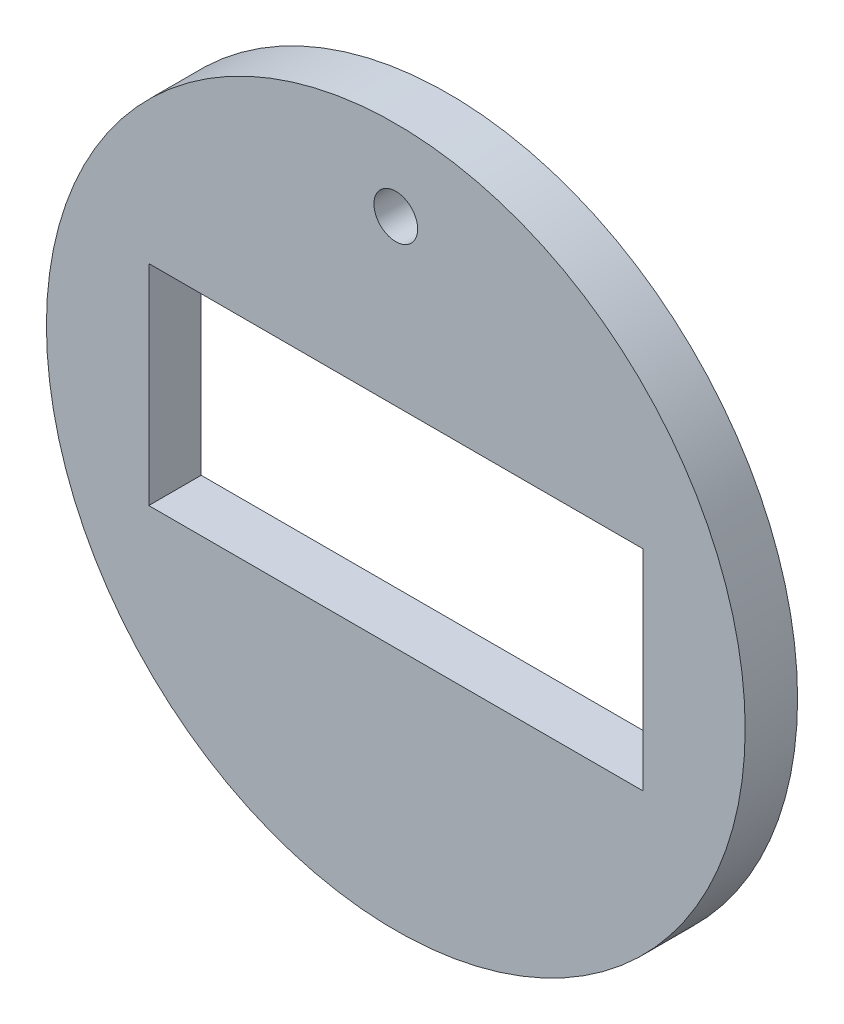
ISO-10303-21;
HEADER;
FILE_DESCRIPTION(('STEP AP214'),'2;1');
FILE_NAME('part.step','',(''),(''),'','','');
FILE_SCHEMA(('AUTOMOTIVE_DESIGN { 1 0 10303 214 1 1 1 1 }'));
ENDSEC;
DATA;
#1=APPLICATION_CONTEXT('core data for automotive mechanical design processes');
#2=APPLICATION_PROTOCOL_DEFINITION('international standard','automotive_design',2000,#1);
#3=PRODUCT_CONTEXT('',#1,'mechanical');
#4=PRODUCT('Part','Part','',(#3));
#5=PRODUCT_RELATED_PRODUCT_CATEGORY('part','',(#4));
#6=PRODUCT_DEFINITION_FORMATION('','',#4);
#7=PRODUCT_DEFINITION_CONTEXT('part definition',#1,'design');
#8=PRODUCT_DEFINITION('design','',#6,#7);
#9=PRODUCT_DEFINITION_SHAPE('','',#8);
#10=(LENGTH_UNIT() NAMED_UNIT(*) SI_UNIT(.MILLI.,.METRE.));
#11=(NAMED_UNIT(*) PLANE_ANGLE_UNIT() SI_UNIT($,.RADIAN.));
#12=(NAMED_UNIT(*) SI_UNIT($,.STERADIAN.) SOLID_ANGLE_UNIT());
#13=UNCERTAINTY_MEASURE_WITH_UNIT(LENGTH_MEASURE(1.E-05),#10,'distance_accuracy_value','');
#14=(GEOMETRIC_REPRESENTATION_CONTEXT(3) GLOBAL_UNCERTAINTY_ASSIGNED_CONTEXT((#13)) GLOBAL_UNIT_ASSIGNED_CONTEXT((#10,
#11,#12)) REPRESENTATION_CONTEXT('',''));
#15=CARTESIAN_POINT('',(0.,0.,0.));
#16=DIRECTION('',(0.,0.,1.));
#17=DIRECTION('',(1.,0.,0.));
#18=AXIS2_PLACEMENT_3D('',#15,#16,#17);
#19=CARTESIAN_POINT('',(0.,0.,3.81));
#20=DIRECTION('',(0.,0.,1.));
#21=DIRECTION('',(1.,0.,0.));
#22=AXIS2_PLACEMENT_3D('',#19,#20,#21);
#23=PLANE('',#22);
#24=CARTESIAN_POINT('',(0.,19.558,3.81));
#25=DIRECTION('',(0.,0.,1.));
#26=DIRECTION('',(1.,0.,0.));
#27=AXIS2_PLACEMENT_3D('',#24,#25,#26);
#28=CIRCLE('',#27,1.5875);
#29=CARTESIAN_POINT('',(-1.5875,19.558,3.81));
#30=VERTEX_POINT('',#29);
#31=EDGE_CURVE('E110',#30,#30,#28,.T.);
#32=ORIENTED_EDGE('',*,*,#31,.F.);
#33=EDGE_LOOP('',(#32));
#34=FACE_BOUND('',#33,.T.);
#35=CARTESIAN_POINT('',(0.,0.,3.81));
#36=DIRECTION('',(0.,0.,1.));
#37=DIRECTION('',(1.,0.,0.));
#38=AXIS2_PLACEMENT_3D('',#35,#36,#37);
#39=CIRCLE('',#38,25.4);
#40=CARTESIAN_POINT('',(-25.4,0.,3.81));
#41=VERTEX_POINT('',#40);
#42=EDGE_CURVE('E11',#41,#41,#39,.T.);
#43=ORIENTED_EDGE('',*,*,#42,.T.);
#44=EDGE_LOOP('',(#43));
#45=FACE_BOUND('',#44,.T.);
#46=DIRECTION('',(1.,0.,0.));
#47=VECTOR('',#46,1.);
#48=CARTESIAN_POINT('',(17.9578,-7.62,3.81));
#49=LINE('',#48,#47);
#50=CARTESIAN_POINT('',(-17.9578,-7.62,3.81));
#51=VERTEX_POINT('',#50);
#52=CARTESIAN_POINT('',(17.9578,-7.62,3.81));
#53=VERTEX_POINT('',#52);
#54=EDGE_CURVE('E98',#51,#53,#49,.T.);
#55=ORIENTED_EDGE('',*,*,#54,.F.);
#56=DIRECTION('',(0.,-1.,0.));
#57=VECTOR('',#56,1.);
#58=CARTESIAN_POINT('',(-17.9578,7.62,3.81));
#59=LINE('',#58,#57);
#60=CARTESIAN_POINT('',(-17.9578,7.62,3.81));
#61=VERTEX_POINT('',#60);
#62=EDGE_CURVE('E87',#61,#51,#59,.T.);
#63=ORIENTED_EDGE('',*,*,#62,.F.);
#64=DIRECTION('',(-1.,0.,0.));
#65=VECTOR('',#64,1.);
#66=CARTESIAN_POINT('',(-17.9578,7.62,3.81));
#67=LINE('',#66,#65);
#68=CARTESIAN_POINT('',(17.9578,7.62,3.81));
#69=VERTEX_POINT('',#68);
#70=EDGE_CURVE('E102',#69,#61,#67,.T.);
#71=ORIENTED_EDGE('',*,*,#70,.F.);
#72=DIRECTION('',(0.,1.,0.));
#73=VECTOR('',#72,1.);
#74=CARTESIAN_POINT('',(17.9578,7.62,3.81));
#75=LINE('',#74,#73);
#76=EDGE_CURVE('E100',#53,#69,#75,.T.);
#77=ORIENTED_EDGE('',*,*,#76,.F.);
#78=EDGE_LOOP('',(#55,#63,#71,#77));
#79=FACE_BOUND('',#78,.T.);
#80=ADVANCED_FACE('F31',(#34,#45,#79),#23,.T.);
#81=CARTESIAN_POINT('',(0.,0.,0.));
#82=DIRECTION('',(0.,0.,1.));
#83=DIRECTION('',(1.,0.,0.));
#84=AXIS2_PLACEMENT_3D('',#81,#82,#83);
#85=PLANE('',#84);
#86=CARTESIAN_POINT('',(0.,19.558,0.));
#87=DIRECTION('',(0.,0.,1.));
#88=DIRECTION('',(1.,0.,0.));
#89=AXIS2_PLACEMENT_3D('',#86,#87,#88);
#90=CIRCLE('',#89,1.5875);
#91=CARTESIAN_POINT('',(-1.5875,19.558,0.));
#92=VERTEX_POINT('',#91);
#93=EDGE_CURVE('E88',#92,#92,#90,.T.);
#94=ORIENTED_EDGE('',*,*,#93,.T.);
#95=EDGE_LOOP('',(#94));
#96=FACE_BOUND('',#95,.T.);
#97=CARTESIAN_POINT('',(0.,0.,0.));
#98=DIRECTION('',(0.,0.,1.));
#99=DIRECTION('',(1.,0.,0.));
#100=AXIS2_PLACEMENT_3D('',#97,#98,#99);
#101=CIRCLE('',#100,25.4);
#102=CARTESIAN_POINT('',(-25.4,0.,0.));
#103=VERTEX_POINT('',#102);
#104=EDGE_CURVE('E39',#103,#103,#101,.T.);
#105=ORIENTED_EDGE('',*,*,#104,.F.);
#106=EDGE_LOOP('',(#105));
#107=FACE_BOUND('',#106,.T.);
#108=DIRECTION('',(0.,-1.,0.));
#109=VECTOR('',#108,1.);
#110=CARTESIAN_POINT('',(-17.9578,7.62,0.));
#111=LINE('',#110,#109);
#112=CARTESIAN_POINT('',(-17.9578,7.62,0.));
#113=VERTEX_POINT('',#112);
#114=CARTESIAN_POINT('',(-17.9578,-7.62,0.));
#115=VERTEX_POINT('',#114);
#116=EDGE_CURVE('E54',#113,#115,#111,.T.);
#117=ORIENTED_EDGE('',*,*,#116,.T.);
#118=DIRECTION('',(1.,0.,0.));
#119=VECTOR('',#118,1.);
#120=CARTESIAN_POINT('',(17.9578,-7.62,0.));
#121=LINE('',#120,#119);
#122=CARTESIAN_POINT('',(17.9578,-7.62,0.));
#123=VERTEX_POINT('',#122);
#124=EDGE_CURVE('E74',#115,#123,#121,.T.);
#125=ORIENTED_EDGE('',*,*,#124,.T.);
#126=DIRECTION('',(0.,1.,0.));
#127=VECTOR('',#126,1.);
#128=CARTESIAN_POINT('',(17.9578,7.62,0.));
#129=LINE('',#128,#127);
#130=CARTESIAN_POINT('',(17.9578,7.62,0.));
#131=VERTEX_POINT('',#130);
#132=EDGE_CURVE('E83',#123,#131,#129,.T.);
#133=ORIENTED_EDGE('',*,*,#132,.T.);
#134=DIRECTION('',(-1.,0.,0.));
#135=VECTOR('',#134,1.);
#136=CARTESIAN_POINT('',(-17.9578,7.62,0.));
#137=LINE('',#136,#135);
#138=EDGE_CURVE('E92',#131,#113,#137,.T.);
#139=ORIENTED_EDGE('',*,*,#138,.T.);
#140=EDGE_LOOP('',(#117,#125,#133,#139));
#141=FACE_BOUND('',#140,.T.);
#142=ADVANCED_FACE('F91',(#96,#107,#141),#85,.F.);
#143=CARTESIAN_POINT('',(0.,0.,3.81));
#144=DIRECTION('',(0.,0.,-1.));
#145=DIRECTION('',(-1.,0.,0.));
#146=AXIS2_PLACEMENT_3D('',#143,#144,#145);
#147=CYLINDRICAL_SURFACE('',#146,25.4);
#148=CARTESIAN_POINT('',(-25.4,0.,3.81));
#149=CARTESIAN_POINT('',(-25.4,0.,3.7703125));
#150=CARTESIAN_POINT('',(-25.4,0.,3.730625));
#151=CARTESIAN_POINT('',(-25.4,0.,3.65125));
#152=CARTESIAN_POINT('',(-25.4,0.,3.6115625));
#153=CARTESIAN_POINT('',(-25.4,0.,3.5321875));
#154=CARTESIAN_POINT('',(-25.4,0.,3.4925));
#155=CARTESIAN_POINT('',(-25.4,0.,3.413125));
#156=CARTESIAN_POINT('',(-25.4,0.,3.3734375));
#157=CARTESIAN_POINT('',(-25.4,0.,3.2940625));
#158=CARTESIAN_POINT('',(-25.4,0.,3.254375));
#159=CARTESIAN_POINT('',(-25.4,0.,3.175));
#160=CARTESIAN_POINT('',(-25.4,0.,3.1353125));
#161=CARTESIAN_POINT('',(-25.4,0.,3.0559375));
#162=CARTESIAN_POINT('',(-25.4,0.,3.01625));
#163=CARTESIAN_POINT('',(-25.4,0.,2.936875));
#164=CARTESIAN_POINT('',(-25.4,0.,2.8971875));
#165=CARTESIAN_POINT('',(-25.4,0.,2.8178125));
#166=CARTESIAN_POINT('',(-25.4,0.,2.778125));
#167=CARTESIAN_POINT('',(-25.4,0.,2.69875));
#168=CARTESIAN_POINT('',(-25.4,0.,2.6590625));
#169=CARTESIAN_POINT('',(-25.4,0.,2.5796875));
#170=CARTESIAN_POINT('',(-25.4,0.,2.54));
#171=CARTESIAN_POINT('',(-25.4,0.,2.460625));
#172=CARTESIAN_POINT('',(-25.4,0.,2.4209375));
#173=CARTESIAN_POINT('',(-25.4,0.,2.3415625));
#174=CARTESIAN_POINT('',(-25.4,0.,2.301875));
#175=CARTESIAN_POINT('',(-25.4,0.,2.2225));
#176=CARTESIAN_POINT('',(-25.4,0.,2.1828125));
#177=CARTESIAN_POINT('',(-25.4,0.,2.1034375));
#178=CARTESIAN_POINT('',(-25.4,0.,2.06375));
#179=CARTESIAN_POINT('',(-25.4,0.,1.984375));
#180=CARTESIAN_POINT('',(-25.4,0.,1.9446875));
#181=CARTESIAN_POINT('',(-25.4,0.,1.8653125));
#182=CARTESIAN_POINT('',(-25.4,0.,1.825625));
#183=CARTESIAN_POINT('',(-25.4,0.,1.74625));
#184=CARTESIAN_POINT('',(-25.4,0.,1.7065625));
#185=CARTESIAN_POINT('',(-25.4,0.,1.6271875));
#186=CARTESIAN_POINT('',(-25.4,0.,1.5875));
#187=CARTESIAN_POINT('',(-25.4,0.,1.508125));
#188=CARTESIAN_POINT('',(-25.4,0.,1.4684375));
#189=CARTESIAN_POINT('',(-25.4,0.,1.3890625));
#190=CARTESIAN_POINT('',(-25.4,0.,1.349375));
#191=CARTESIAN_POINT('',(-25.4,0.,1.27));
#192=CARTESIAN_POINT('',(-25.4,0.,1.2303125));
#193=CARTESIAN_POINT('',(-25.4,0.,1.1509375));
#194=CARTESIAN_POINT('',(-25.4,0.,1.11125));
#195=CARTESIAN_POINT('',(-25.4,0.,1.031875));
#196=CARTESIAN_POINT('',(-25.4,0.,0.9921875));
#197=CARTESIAN_POINT('',(-25.4,0.,0.9128125));
#198=CARTESIAN_POINT('',(-25.4,0.,0.873125));
#199=CARTESIAN_POINT('',(-25.4,0.,0.79375));
#200=CARTESIAN_POINT('',(-25.4,0.,0.7540625));
#201=CARTESIAN_POINT('',(-25.4,0.,0.6746875));
#202=CARTESIAN_POINT('',(-25.4,0.,0.635));
#203=CARTESIAN_POINT('',(-25.4,0.,0.555625));
#204=CARTESIAN_POINT('',(-25.4,0.,0.5159375));
#205=CARTESIAN_POINT('',(-25.4,0.,0.4365625));
#206=CARTESIAN_POINT('',(-25.4,0.,0.396875));
#207=CARTESIAN_POINT('',(-25.4,0.,0.3175));
#208=CARTESIAN_POINT('',(-25.4,0.,0.2778125));
#209=CARTESIAN_POINT('',(-25.4,0.,0.1984375));
#210=CARTESIAN_POINT('',(-25.4,0.,0.15875));
#211=CARTESIAN_POINT('',(-25.4,0.,0.0793749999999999));
#212=CARTESIAN_POINT('',(-25.4,0.,0.0396874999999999));
#213=CARTESIAN_POINT('',(-25.4,0.,0.));
#214=B_SPLINE_CURVE_WITH_KNOTS('',3,(#148,#149,#150,#151,#152,#153,#154,#155,#156,#157,#158,
#159,#160,#161,#162,#163,#164,#165,#166,#167,#168,#169,#170,#171,#172,#173,#174,#175,#176,#177,
#178,#179,#180,#181,#182,#183,#184,#185,#186,#187,#188,#189,#190,#191,#192,#193,#194,#195,#196,
#197,#198,#199,#200,#201,#202,#203,#204,#205,#206,#207,#208,#209,#210,#211,#212,#213),
.UNSPECIFIED.,.F.,.F.,(4,2,2,2,2,2,2,2,2,2,2,2,2,2,2,2,2,2,2,2,2,2,2,2,2,2,2,2,2,2,2,2,4),(0.,
0.1190625,0.238125,0.3571875,0.47625,0.595312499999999,0.714375,0.833437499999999,
0.952499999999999,1.0715625,1.190625,1.3096875,1.42875,1.5478125,1.666875,1.7859375,1.905,
2.0240625,2.143125,2.2621875,2.38125,2.5003125,2.619375,2.7384375,2.8575,2.9765625,3.095625,
3.2146875,3.33375,3.4528125,3.571875,3.6909375,3.81),.UNSPECIFIED.);
#215=EDGE_CURVE('BSEAM33',#41,#103,#214,.T.);
#216=ORIENTED_EDGE('',*,*,#42,.F.);
#217=ORIENTED_EDGE('',*,*,#104,.T.);
#218=ORIENTED_EDGE('',*,*,#215,.T.);
#219=ORIENTED_EDGE('',*,*,#215,.F.);
#220=EDGE_LOOP('',(#216,#218,#217,#219));
#221=FACE_BOUND('',#220,.T.);
#222=ADVANCED_FACE('F33',(#221),#147,.T.);
#223=CARTESIAN_POINT('',(0.,19.558,3.81));
#224=DIRECTION('',(0.,0.,-1.));
#225=DIRECTION('',(-1.,0.,0.));
#226=AXIS2_PLACEMENT_3D('',#223,#224,#225);
#227=CYLINDRICAL_SURFACE('',#226,1.5875);
#228=CARTESIAN_POINT('',(-1.5875,19.558,3.81));
#229=CARTESIAN_POINT('',(-1.5875,19.558,3.7703125));
#230=CARTESIAN_POINT('',(-1.5875,19.558,3.730625));
#231=CARTESIAN_POINT('',(-1.5875,19.558,3.65125));
#232=CARTESIAN_POINT('',(-1.5875,19.558,3.6115625));
#233=CARTESIAN_POINT('',(-1.5875,19.558,3.5321875));
#234=CARTESIAN_POINT('',(-1.5875,19.558,3.4925));
#235=CARTESIAN_POINT('',(-1.5875,19.558,3.413125));
#236=CARTESIAN_POINT('',(-1.5875,19.558,3.3734375));
#237=CARTESIAN_POINT('',(-1.5875,19.558,3.2940625));
#238=CARTESIAN_POINT('',(-1.5875,19.558,3.254375));
#239=CARTESIAN_POINT('',(-1.5875,19.558,3.175));
#240=CARTESIAN_POINT('',(-1.5875,19.558,3.1353125));
#241=CARTESIAN_POINT('',(-1.5875,19.558,3.0559375));
#242=CARTESIAN_POINT('',(-1.5875,19.558,3.01625));
#243=CARTESIAN_POINT('',(-1.5875,19.558,2.936875));
#244=CARTESIAN_POINT('',(-1.5875,19.558,2.8971875));
#245=CARTESIAN_POINT('',(-1.5875,19.558,2.8178125));
#246=CARTESIAN_POINT('',(-1.5875,19.558,2.778125));
#247=CARTESIAN_POINT('',(-1.5875,19.558,2.69875));
#248=CARTESIAN_POINT('',(-1.5875,19.558,2.6590625));
#249=CARTESIAN_POINT('',(-1.5875,19.558,2.5796875));
#250=CARTESIAN_POINT('',(-1.5875,19.558,2.54));
#251=CARTESIAN_POINT('',(-1.5875,19.558,2.460625));
#252=CARTESIAN_POINT('',(-1.5875,19.558,2.4209375));
#253=CARTESIAN_POINT('',(-1.5875,19.558,2.3415625));
#254=CARTESIAN_POINT('',(-1.5875,19.558,2.301875));
#255=CARTESIAN_POINT('',(-1.5875,19.558,2.2225));
#256=CARTESIAN_POINT('',(-1.5875,19.558,2.1828125));
#257=CARTESIAN_POINT('',(-1.5875,19.558,2.1034375));
#258=CARTESIAN_POINT('',(-1.5875,19.558,2.06375));
#259=CARTESIAN_POINT('',(-1.5875,19.558,1.984375));
#260=CARTESIAN_POINT('',(-1.5875,19.558,1.9446875));
#261=CARTESIAN_POINT('',(-1.5875,19.558,1.8653125));
#262=CARTESIAN_POINT('',(-1.5875,19.558,1.825625));
#263=CARTESIAN_POINT('',(-1.5875,19.558,1.74625));
#264=CARTESIAN_POINT('',(-1.5875,19.558,1.7065625));
#265=CARTESIAN_POINT('',(-1.5875,19.558,1.6271875));
#266=CARTESIAN_POINT('',(-1.5875,19.558,1.5875));
#267=CARTESIAN_POINT('',(-1.5875,19.558,1.508125));
#268=CARTESIAN_POINT('',(-1.5875,19.558,1.4684375));
#269=CARTESIAN_POINT('',(-1.5875,19.558,1.3890625));
#270=CARTESIAN_POINT('',(-1.5875,19.558,1.349375));
#271=CARTESIAN_POINT('',(-1.5875,19.558,1.27));
#272=CARTESIAN_POINT('',(-1.5875,19.558,1.2303125));
#273=CARTESIAN_POINT('',(-1.5875,19.558,1.1509375));
#274=CARTESIAN_POINT('',(-1.5875,19.558,1.11125));
#275=CARTESIAN_POINT('',(-1.5875,19.558,1.031875));
#276=CARTESIAN_POINT('',(-1.5875,19.558,0.9921875));
#277=CARTESIAN_POINT('',(-1.5875,19.558,0.9128125));
#278=CARTESIAN_POINT('',(-1.5875,19.558,0.873125));
#279=CARTESIAN_POINT('',(-1.5875,19.558,0.79375));
#280=CARTESIAN_POINT('',(-1.5875,19.558,0.7540625));
#281=CARTESIAN_POINT('',(-1.5875,19.558,0.6746875));
#282=CARTESIAN_POINT('',(-1.5875,19.558,0.635));
#283=CARTESIAN_POINT('',(-1.5875,19.558,0.555625));
#284=CARTESIAN_POINT('',(-1.5875,19.558,0.5159375));
#285=CARTESIAN_POINT('',(-1.5875,19.558,0.4365625));
#286=CARTESIAN_POINT('',(-1.5875,19.558,0.396875));
#287=CARTESIAN_POINT('',(-1.5875,19.558,0.3175));
#288=CARTESIAN_POINT('',(-1.5875,19.558,0.2778125));
#289=CARTESIAN_POINT('',(-1.5875,19.558,0.1984375));
#290=CARTESIAN_POINT('',(-1.5875,19.558,0.15875));
#291=CARTESIAN_POINT('',(-1.5875,19.558,0.0793749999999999));
#292=CARTESIAN_POINT('',(-1.5875,19.558,0.0396874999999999));
#293=CARTESIAN_POINT('',(-1.5875,19.558,0.));
#294=B_SPLINE_CURVE_WITH_KNOTS('',3,(#228,#229,#230,#231,#232,#233,#234,#235,#236,#237,#238,
#239,#240,#241,#242,#243,#244,#245,#246,#247,#248,#249,#250,#251,#252,#253,#254,#255,#256,#257,
#258,#259,#260,#261,#262,#263,#264,#265,#266,#267,#268,#269,#270,#271,#272,#273,#274,#275,#276,
#277,#278,#279,#280,#281,#282,#283,#284,#285,#286,#287,#288,#289,#290,#291,#292,#293),
.UNSPECIFIED.,.F.,.F.,(4,2,2,2,2,2,2,2,2,2,2,2,2,2,2,2,2,2,2,2,2,2,2,2,2,2,2,2,2,2,2,2,4),(0.,
0.1190625,0.238125,0.3571875,0.47625,0.5953125,0.714375,0.8334375,0.9525,1.0715625,1.190625,
1.3096875,1.42875,1.5478125,1.666875,1.7859375,1.905,2.0240625,2.143125,2.2621875,2.38125,
2.5003125,2.619375,2.7384375,2.8575,2.9765625,3.095625,3.2146875,3.33375,3.4528125,3.571875,
3.6909375,3.81),.UNSPECIFIED.);
#295=EDGE_CURVE('BSEAM123',#30,#92,#294,.T.);
#296=ORIENTED_EDGE('',*,*,#31,.T.);
#297=ORIENTED_EDGE('',*,*,#93,.F.);
#298=ORIENTED_EDGE('',*,*,#295,.T.);
#299=ORIENTED_EDGE('',*,*,#295,.F.);
#300=EDGE_LOOP('',(#296,#298,#297,#299));
#301=FACE_BOUND('',#300,.T.);
#302=ADVANCED_FACE('F123',(#301),#227,.F.);
#303=CARTESIAN_POINT('',(-17.9578,7.62,3.81));
#304=DIRECTION('',(1.,0.,0.));
#305=DIRECTION('',(0.,1.,0.));
#306=AXIS2_PLACEMENT_3D('',#303,#304,#305);
#307=PLANE('',#306);
#308=ORIENTED_EDGE('',*,*,#116,.F.);
#309=DIRECTION('',(0.,0.,-1.));
#310=VECTOR('',#309,1.);
#311=CARTESIAN_POINT('',(-17.9578,7.62,3.81));
#312=LINE('',#311,#310);
#313=EDGE_CURVE('E104',#61,#113,#312,.T.);
#314=ORIENTED_EDGE('',*,*,#313,.F.);
#315=ORIENTED_EDGE('',*,*,#62,.T.);
#316=DIRECTION('',(0.,0.,-1.));
#317=VECTOR('',#316,1.);
#318=CARTESIAN_POINT('',(-17.9578,-7.62,3.81));
#319=LINE('',#318,#317);
#320=EDGE_CURVE('E76',#51,#115,#319,.T.);
#321=ORIENTED_EDGE('',*,*,#320,.T.);
#322=EDGE_LOOP('',(#308,#314,#315,#321));
#323=FACE_BOUND('',#322,.T.);
#324=ADVANCED_FACE('F85',(#323),#307,.T.);
#325=CARTESIAN_POINT('',(17.9578,-7.62,3.81));
#326=DIRECTION('',(0.,1.,0.));
#327=DIRECTION('',(0.,0.,1.));
#328=AXIS2_PLACEMENT_3D('',#325,#326,#327);
#329=PLANE('',#328);
#330=ORIENTED_EDGE('',*,*,#124,.F.);
#331=ORIENTED_EDGE('',*,*,#320,.F.);
#332=ORIENTED_EDGE('',*,*,#54,.T.);
#333=DIRECTION('',(0.,0.,-1.));
#334=VECTOR('',#333,1.);
#335=CARTESIAN_POINT('',(17.9578,-7.62,3.81));
#336=LINE('',#335,#334);
#337=EDGE_CURVE('E79',#53,#123,#336,.T.);
#338=ORIENTED_EDGE('',*,*,#337,.T.);
#339=EDGE_LOOP('',(#330,#331,#332,#338));
#340=FACE_BOUND('',#339,.T.);
#341=ADVANCED_FACE('F75',(#340),#329,.T.);
#342=CARTESIAN_POINT('',(17.9578,7.62,3.81));
#343=DIRECTION('',(-1.,0.,0.));
#344=DIRECTION('',(0.,0.,1.));
#345=AXIS2_PLACEMENT_3D('',#342,#343,#344);
#346=PLANE('',#345);
#347=ORIENTED_EDGE('',*,*,#132,.F.);
#348=ORIENTED_EDGE('',*,*,#337,.F.);
#349=ORIENTED_EDGE('',*,*,#76,.T.);
#350=DIRECTION('',(0.,0.,-1.));
#351=VECTOR('',#350,1.);
#352=CARTESIAN_POINT('',(17.9578,7.62,3.81));
#353=LINE('',#352,#351);
#354=EDGE_CURVE('E46',#69,#131,#353,.T.);
#355=ORIENTED_EDGE('',*,*,#354,.T.);
#356=EDGE_LOOP('',(#347,#348,#349,#355));
#357=FACE_BOUND('',#356,.T.);
#358=ADVANCED_FACE('F134',(#357),#346,.T.);
#359=CARTESIAN_POINT('',(-17.9578,7.62,3.81));
#360=DIRECTION('',(0.,-1.,0.));
#361=DIRECTION('',(0.,0.,-1.));
#362=AXIS2_PLACEMENT_3D('',#359,#360,#361);
#363=PLANE('',#362);
#364=ORIENTED_EDGE('',*,*,#138,.F.);
#365=ORIENTED_EDGE('',*,*,#354,.F.);
#366=ORIENTED_EDGE('',*,*,#70,.T.);
#367=ORIENTED_EDGE('',*,*,#313,.T.);
#368=EDGE_LOOP('',(#364,#365,#366,#367));
#369=FACE_BOUND('',#368,.T.);
#370=ADVANCED_FACE('F137',(#369),#363,.T.);
#371=CLOSED_SHELL('',(#80,#142,#222,#302,#324,#341,#358,#370));
#372=MANIFOLD_SOLID_BREP('B2',#371);
#373=ADVANCED_BREP_SHAPE_REPRESENTATION('',(#18,#372),#14);
#374=SHAPE_DEFINITION_REPRESENTATION(#9,#373);
ENDSEC;
END-ISO-10303-21;
